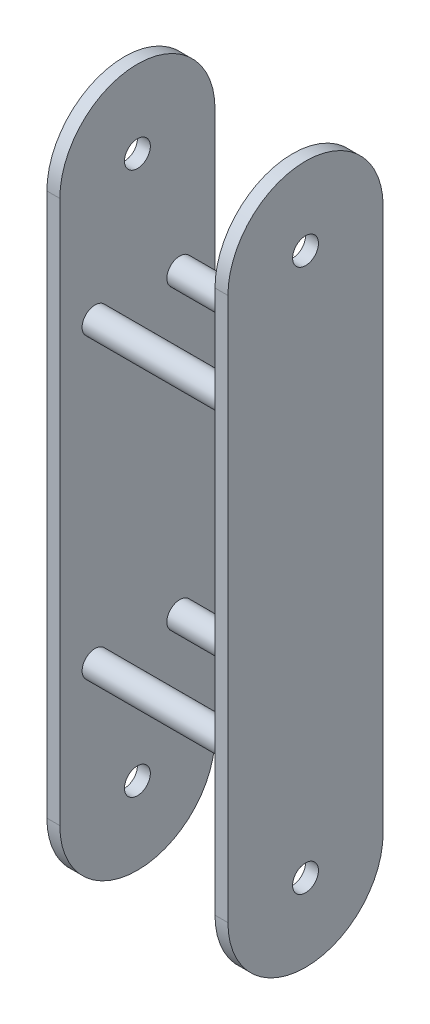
ISO-10303-21;
HEADER;
FILE_DESCRIPTION(('STEP AP214'),'2;1');
FILE_NAME('part.step','',(''),(''),'','','');
FILE_SCHEMA(('AUTOMOTIVE_DESIGN { 1 0 10303 214 1 1 1 1 }'));
ENDSEC;
DATA;
#1=APPLICATION_CONTEXT('core data for automotive mechanical design processes');
#2=APPLICATION_PROTOCOL_DEFINITION('international standard','automotive_design',2000,#1);
#3=PRODUCT_CONTEXT('',#1,'mechanical');
#4=PRODUCT('Part','Part','',(#3));
#5=PRODUCT_RELATED_PRODUCT_CATEGORY('part','',(#4));
#6=PRODUCT_DEFINITION_FORMATION('','',#4);
#7=PRODUCT_DEFINITION_CONTEXT('part definition',#1,'design');
#8=PRODUCT_DEFINITION('design','',#6,#7);
#9=PRODUCT_DEFINITION_SHAPE('','',#8);
#10=(LENGTH_UNIT() NAMED_UNIT(*) SI_UNIT(.MILLI.,.METRE.));
#11=(NAMED_UNIT(*) PLANE_ANGLE_UNIT() SI_UNIT($,.RADIAN.));
#12=(NAMED_UNIT(*) SI_UNIT($,.STERADIAN.) SOLID_ANGLE_UNIT());
#13=UNCERTAINTY_MEASURE_WITH_UNIT(LENGTH_MEASURE(1.E-05),#10,'distance_accuracy_value','');
#14=(GEOMETRIC_REPRESENTATION_CONTEXT(3) GLOBAL_UNCERTAINTY_ASSIGNED_CONTEXT((#13)) GLOBAL_UNIT_ASSIGNED_CONTEXT((#10,
#11,#12)) REPRESENTATION_CONTEXT('',''));
#15=CARTESIAN_POINT('',(0.,0.,0.));
#16=DIRECTION('',(0.,0.,1.));
#17=DIRECTION('',(1.,0.,0.));
#18=AXIS2_PLACEMENT_3D('',#15,#16,#17);
#19=CARTESIAN_POINT('',(30.,0.,30.));
#20=DIRECTION('',(0.,0.,1.));
#21=DIRECTION('',(1.,0.,0.));
#22=AXIS2_PLACEMENT_3D('',#19,#20,#21);
#23=PLANE('',#22);
#24=DIRECTION('',(0.,-1.,0.));
#25=VECTOR('',#24,1.);
#26=CARTESIAN_POINT('',(35.,0.,30.));
#27=LINE('',#26,#25);
#28=CARTESIAN_POINT('',(35.,105.,30.));
#29=VERTEX_POINT('',#28);
#30=CARTESIAN_POINT('',(35.,-105.,30.));
#31=VERTEX_POINT('',#30);
#32=EDGE_CURVE('E169',#29,#31,#27,.T.);
#33=ORIENTED_EDGE('',*,*,#32,.F.);
#34=DIRECTION('',(1.,0.,0.));
#35=VECTOR('',#34,1.);
#36=CARTESIAN_POINT('',(30.,105.,30.));
#37=LINE('',#36,#35);
#38=CARTESIAN_POINT('',(30.,105.,30.));
#39=VERTEX_POINT('',#38);
#40=EDGE_CURVE('E60',#39,#29,#37,.T.);
#41=ORIENTED_EDGE('',*,*,#40,.F.);
#42=DIRECTION('',(0.,-1.,0.));
#43=VECTOR('',#42,1.);
#44=CARTESIAN_POINT('',(30.,0.,30.));
#45=LINE('',#44,#43);
#46=CARTESIAN_POINT('',(30.,-105.,30.));
#47=VERTEX_POINT('',#46);
#48=EDGE_CURVE('E170',#39,#47,#45,.T.);
#49=ORIENTED_EDGE('',*,*,#48,.T.);
#50=DIRECTION('',(1.,0.,0.));
#51=VECTOR('',#50,1.);
#52=CARTESIAN_POINT('',(30.,-105.,30.));
#53=LINE('',#52,#51);
#54=EDGE_CURVE('E86',#47,#31,#53,.T.);
#55=ORIENTED_EDGE('',*,*,#54,.T.);
#56=EDGE_LOOP('',(#33,#41,#49,#55));
#57=FACE_BOUND('',#56,.T.);
#58=ADVANCED_FACE('F41',(#57),#23,.T.);
#59=CARTESIAN_POINT('',(30.,105.,0.));
#60=DIRECTION('',(1.,0.,0.));
#61=DIRECTION('',(0.,0.,-1.));
#62=AXIS2_PLACEMENT_3D('',#59,#60,#61);
#63=CYLINDRICAL_SURFACE('',#62,30.);
#64=CARTESIAN_POINT('',(35.,105.,0.));
#65=DIRECTION('',(1.,0.,0.));
#66=DIRECTION('',(0.,0.,-1.));
#67=AXIS2_PLACEMENT_3D('',#64,#65,#66);
#68=CIRCLE('',#67,30.);
#69=CARTESIAN_POINT('',(35.,105.,-30.));
#70=VERTEX_POINT('',#69);
#71=EDGE_CURVE('E78',#29,#70,#68,.F.);
#72=ORIENTED_EDGE('',*,*,#71,.T.);
#73=DIRECTION('',(1.,0.,0.));
#74=VECTOR('',#73,1.);
#75=CARTESIAN_POINT('',(30.,105.,-30.));
#76=LINE('',#75,#74);
#77=CARTESIAN_POINT('',(30.,105.,-30.));
#78=VERTEX_POINT('',#77);
#79=EDGE_CURVE('E197',#78,#70,#76,.T.);
#80=ORIENTED_EDGE('',*,*,#79,.F.);
#81=CARTESIAN_POINT('',(30.,105.,0.));
#82=DIRECTION('',(1.,0.,0.));
#83=DIRECTION('',(0.,0.,-1.));
#84=AXIS2_PLACEMENT_3D('',#81,#82,#83);
#85=CIRCLE('',#84,30.);
#86=EDGE_CURVE('E179',#39,#78,#85,.F.);
#87=ORIENTED_EDGE('',*,*,#86,.F.);
#88=ORIENTED_EDGE('',*,*,#40,.T.);
#89=EDGE_LOOP('',(#72,#80,#87,#88));
#90=FACE_BOUND('',#89,.T.);
#91=ADVANCED_FACE('F212',(#90),#63,.T.);
#92=CARTESIAN_POINT('',(30.,0.,-30.));
#93=DIRECTION('',(0.,0.,1.));
#94=DIRECTION('',(1.,0.,0.));
#95=AXIS2_PLACEMENT_3D('',#92,#93,#94);
#96=PLANE('',#95);
#97=DIRECTION('',(0.,-1.,0.));
#98=VECTOR('',#97,1.);
#99=CARTESIAN_POINT('',(35.,0.,-30.));
#100=LINE('',#99,#98);
#101=CARTESIAN_POINT('',(35.,-105.,-30.));
#102=VERTEX_POINT('',#101);
#103=EDGE_CURVE('E189',#70,#102,#100,.T.);
#104=ORIENTED_EDGE('',*,*,#103,.T.);
#105=DIRECTION('',(1.,0.,0.));
#106=VECTOR('',#105,1.);
#107=CARTESIAN_POINT('',(30.,-105.,-30.));
#108=LINE('',#107,#106);
#109=CARTESIAN_POINT('',(30.,-105.,-30.));
#110=VERTEX_POINT('',#109);
#111=EDGE_CURVE('E200',#110,#102,#108,.T.);
#112=ORIENTED_EDGE('',*,*,#111,.F.);
#113=DIRECTION('',(0.,-1.,0.));
#114=VECTOR('',#113,1.);
#115=CARTESIAN_POINT('',(30.,0.,-30.));
#116=LINE('',#115,#114);
#117=EDGE_CURVE('E176',#78,#110,#116,.T.);
#118=ORIENTED_EDGE('',*,*,#117,.F.);
#119=ORIENTED_EDGE('',*,*,#79,.T.);
#120=EDGE_LOOP('',(#104,#112,#118,#119));
#121=FACE_BOUND('',#120,.T.);
#122=ADVANCED_FACE('F210',(#121),#96,.F.);
#123=CARTESIAN_POINT('',(30.,-105.,0.));
#124=DIRECTION('',(1.,0.,0.));
#125=DIRECTION('',(0.,0.,-1.));
#126=AXIS2_PLACEMENT_3D('',#123,#124,#125);
#127=CYLINDRICAL_SURFACE('',#126,30.);
#128=CARTESIAN_POINT('',(35.,-105.,0.));
#129=DIRECTION('',(1.,0.,0.));
#130=DIRECTION('',(0.,0.,-1.));
#131=AXIS2_PLACEMENT_3D('',#128,#129,#130);
#132=CIRCLE('',#131,30.);
#133=EDGE_CURVE('E185',#31,#102,#132,.T.);
#134=ORIENTED_EDGE('',*,*,#133,.F.);
#135=ORIENTED_EDGE('',*,*,#54,.F.);
#136=CARTESIAN_POINT('',(30.,-105.,0.));
#137=DIRECTION('',(1.,0.,0.));
#138=DIRECTION('',(0.,0.,-1.));
#139=AXIS2_PLACEMENT_3D('',#136,#137,#138);
#140=CIRCLE('',#139,30.);
#141=EDGE_CURVE('E173',#47,#110,#140,.T.);
#142=ORIENTED_EDGE('',*,*,#141,.T.);
#143=ORIENTED_EDGE('',*,*,#111,.T.);
#144=EDGE_LOOP('',(#134,#135,#142,#143));
#145=FACE_BOUND('',#144,.T.);
#146=ADVANCED_FACE('F204',(#145),#127,.T.);
#147=CARTESIAN_POINT('',(30.,0.,0.));
#148=DIRECTION('',(1.,0.,0.));
#149=DIRECTION('',(0.,0.,-1.));
#150=AXIS2_PLACEMENT_3D('',#147,#148,#149);
#151=PLANE('',#150);
#152=CARTESIAN_POINT('',(30.,-57.5285251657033,16.3848494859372));
#153=DIRECTION('',(1.,0.,0.));
#154=DIRECTION('',(0.,0.,-1.));
#155=AXIS2_PLACEMENT_3D('',#152,#153,#154);
#156=CIRCLE('',#155,5.);
#157=CARTESIAN_POINT('',(30.,-57.5285251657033,11.3848494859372));
#158=VERTEX_POINT('',#157);
#159=EDGE_CURVE('E396',#158,#158,#156,.T.);
#160=ORIENTED_EDGE('',*,*,#159,.T.);
#161=EDGE_LOOP('',(#160));
#162=FACE_BOUND('',#161,.T.);
#163=CARTESIAN_POINT('',(30.,-57.5285251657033,-16.3848494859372));
#164=DIRECTION('',(1.,0.,0.));
#165=DIRECTION('',(0.,0.,-1.));
#166=AXIS2_PLACEMENT_3D('',#163,#164,#165);
#167=CIRCLE('',#166,5.);
#168=CARTESIAN_POINT('',(30.,-57.5285251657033,-21.3848494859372));
#169=VERTEX_POINT('',#168);
#170=EDGE_CURVE('E398',#169,#169,#167,.T.);
#171=ORIENTED_EDGE('',*,*,#170,.T.);
#172=EDGE_LOOP('',(#171));
#173=FACE_BOUND('',#172,.T.);
#174=CARTESIAN_POINT('',(30.,57.5285251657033,-16.3848494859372));
#175=DIRECTION('',(1.,0.,0.));
#176=DIRECTION('',(0.,0.,-1.));
#177=AXIS2_PLACEMENT_3D('',#174,#175,#176);
#178=CIRCLE('',#177,5.);
#179=CARTESIAN_POINT('',(30.,57.5285251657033,-21.3848494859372));
#180=VERTEX_POINT('',#179);
#181=EDGE_CURVE('E402',#180,#180,#178,.T.);
#182=ORIENTED_EDGE('',*,*,#181,.T.);
#183=EDGE_LOOP('',(#182));
#184=FACE_BOUND('',#183,.T.);
#185=CARTESIAN_POINT('',(30.,57.5285251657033,16.3848494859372));
#186=DIRECTION('',(1.,0.,0.));
#187=DIRECTION('',(0.,0.,-1.));
#188=AXIS2_PLACEMENT_3D('',#185,#186,#187);
#189=CIRCLE('',#188,5.);
#190=CARTESIAN_POINT('',(30.,57.5285251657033,11.3848494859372));
#191=VERTEX_POINT('',#190);
#192=EDGE_CURVE('E143',#191,#191,#189,.T.);
#193=ORIENTED_EDGE('',*,*,#192,.T.);
#194=EDGE_LOOP('',(#193));
#195=FACE_BOUND('',#194,.T.);
#196=CARTESIAN_POINT('',(30.,105.,0.));
#197=DIRECTION('',(1.,0.,0.));
#198=DIRECTION('',(0.,0.,-1.));
#199=AXIS2_PLACEMENT_3D('',#196,#197,#198);
#200=CIRCLE('',#199,5.);
#201=CARTESIAN_POINT('',(30.,105.,-5.));
#202=VERTEX_POINT('',#201);
#203=EDGE_CURVE('E165',#202,#202,#200,.T.);
#204=ORIENTED_EDGE('',*,*,#203,.T.);
#205=EDGE_LOOP('',(#204));
#206=FACE_BOUND('',#205,.T.);
#207=CARTESIAN_POINT('',(30.,-105.,0.));
#208=DIRECTION('',(1.,0.,0.));
#209=DIRECTION('',(0.,0.,-1.));
#210=AXIS2_PLACEMENT_3D('',#207,#208,#209);
#211=CIRCLE('',#210,5.);
#212=CARTESIAN_POINT('',(30.,-105.,-5.));
#213=VERTEX_POINT('',#212);
#214=EDGE_CURVE('E158',#213,#213,#211,.T.);
#215=ORIENTED_EDGE('',*,*,#214,.T.);
#216=EDGE_LOOP('',(#215));
#217=FACE_BOUND('',#216,.T.);
#218=ORIENTED_EDGE('',*,*,#48,.F.);
#219=ORIENTED_EDGE('',*,*,#86,.T.);
#220=ORIENTED_EDGE('',*,*,#117,.T.);
#221=ORIENTED_EDGE('',*,*,#141,.F.);
#222=EDGE_LOOP('',(#218,#219,#220,#221));
#223=FACE_BOUND('',#222,.T.);
#224=ADVANCED_FACE('F214',(#162,#173,#184,#195,#206,#217,#223),#151,.F.);
#225=CARTESIAN_POINT('',(35.,0.,0.));
#226=DIRECTION('',(1.,0.,0.));
#227=DIRECTION('',(0.,0.,-1.));
#228=AXIS2_PLACEMENT_3D('',#225,#226,#227);
#229=PLANE('',#228);
#230=CARTESIAN_POINT('',(35.,105.,0.));
#231=DIRECTION('',(1.,0.,0.));
#232=DIRECTION('',(0.,0.,-1.));
#233=AXIS2_PLACEMENT_3D('',#230,#231,#232);
#234=CIRCLE('',#233,5.);
#235=CARTESIAN_POINT('',(35.,105.,-5.));
#236=VERTEX_POINT('',#235);
#237=EDGE_CURVE('E154',#236,#236,#234,.T.);
#238=ORIENTED_EDGE('',*,*,#237,.F.);
#239=EDGE_LOOP('',(#238));
#240=FACE_BOUND('',#239,.T.);
#241=CARTESIAN_POINT('',(35.,-105.,0.));
#242=DIRECTION('',(1.,0.,0.));
#243=DIRECTION('',(0.,0.,-1.));
#244=AXIS2_PLACEMENT_3D('',#241,#242,#243);
#245=CIRCLE('',#244,5.);
#246=CARTESIAN_POINT('',(35.,-105.,-5.));
#247=VERTEX_POINT('',#246);
#248=EDGE_CURVE('E148',#247,#247,#245,.T.);
#249=ORIENTED_EDGE('',*,*,#248,.F.);
#250=EDGE_LOOP('',(#249));
#251=FACE_BOUND('',#250,.T.);
#252=ORIENTED_EDGE('',*,*,#32,.T.);
#253=ORIENTED_EDGE('',*,*,#133,.T.);
#254=ORIENTED_EDGE('',*,*,#103,.F.);
#255=ORIENTED_EDGE('',*,*,#71,.F.);
#256=EDGE_LOOP('',(#252,#253,#254,#255));
#257=FACE_BOUND('',#256,.T.);
#258=ADVANCED_FACE('F208',(#240,#251,#257),#229,.T.);
#259=CARTESIAN_POINT('',(-35.,-105.,0.));
#260=DIRECTION('',(1.,0.,0.));
#261=DIRECTION('',(0.,0.,-1.));
#262=AXIS2_PLACEMENT_3D('',#259,#260,#261);
#263=CYLINDRICAL_SURFACE('',#262,5.);
#264=ORIENTED_EDGE('',*,*,#248,.T.);
#265=EDGE_LOOP('',(#264));
#266=FACE_BOUND('',#265,.T.);
#267=ORIENTED_EDGE('',*,*,#214,.F.);
#268=EDGE_LOOP('',(#267));
#269=FACE_BOUND('',#268,.T.);
#270=ADVANCED_FACE('F222',(#266,#269),#263,.F.);
#271=CARTESIAN_POINT('',(-35.,105.,0.));
#272=DIRECTION('',(1.,0.,0.));
#273=DIRECTION('',(0.,0.,-1.));
#274=AXIS2_PLACEMENT_3D('',#271,#272,#273);
#275=CYLINDRICAL_SURFACE('',#274,5.);
#276=ORIENTED_EDGE('',*,*,#237,.T.);
#277=EDGE_LOOP('',(#276));
#278=FACE_BOUND('',#277,.T.);
#279=ORIENTED_EDGE('',*,*,#203,.F.);
#280=EDGE_LOOP('',(#279));
#281=FACE_BOUND('',#280,.T.);
#282=ADVANCED_FACE('F253',(#278,#281),#275,.F.);
#283=CARTESIAN_POINT('',(-35.,57.5285251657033,16.3848494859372));
#284=DIRECTION('',(1.,0.,0.));
#285=DIRECTION('',(0.,0.,-1.));
#286=AXIS2_PLACEMENT_3D('',#283,#284,#285);
#287=CYLINDRICAL_SURFACE('',#286,5.);
#288=CARTESIAN_POINT('',(-30.,57.5285251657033,16.3848494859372));
#289=DIRECTION('',(1.,0.,0.));
#290=DIRECTION('',(0.,0.,-1.));
#291=AXIS2_PLACEMENT_3D('',#288,#289,#290);
#292=CIRCLE('',#291,5.);
#293=CARTESIAN_POINT('',(-30.,57.5285251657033,11.3848494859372));
#294=VERTEX_POINT('',#293);
#295=EDGE_CURVE('E44',#294,#294,#292,.F.);
#296=ORIENTED_EDGE('',*,*,#295,.F.);
#297=EDGE_LOOP('',(#296));
#298=FACE_BOUND('',#297,.T.);
#299=ORIENTED_EDGE('',*,*,#192,.F.);
#300=EDGE_LOOP('',(#299));
#301=FACE_BOUND('',#300,.T.);
#302=ADVANCED_FACE('F262',(#298,#301),#287,.T.);
#303=CARTESIAN_POINT('',(-30.,-105.,0.));
#304=DIRECTION('',(-1.,0.,0.));
#305=DIRECTION('',(0.,0.,1.));
#306=AXIS2_PLACEMENT_3D('',#303,#304,#305);
#307=CYLINDRICAL_SURFACE('',#306,30.);
#308=CARTESIAN_POINT('',(-35.,-105.,0.));
#309=DIRECTION('',(1.,0.,0.));
#310=DIRECTION('',(0.,0.,-1.));
#311=AXIS2_PLACEMENT_3D('',#308,#309,#310);
#312=CIRCLE('',#311,30.);
#313=CARTESIAN_POINT('',(-35.,-105.,30.));
#314=VERTEX_POINT('',#313);
#315=CARTESIAN_POINT('',(-35.,-105.,-30.));
#316=VERTEX_POINT('',#315);
#317=EDGE_CURVE('E141',#314,#316,#312,.T.);
#318=ORIENTED_EDGE('',*,*,#317,.T.);
#319=DIRECTION('',(-1.,0.,0.));
#320=VECTOR('',#319,1.);
#321=CARTESIAN_POINT('',(-30.,-105.,-30.));
#322=LINE('',#321,#320);
#323=CARTESIAN_POINT('',(-30.,-105.,-30.));
#324=VERTEX_POINT('',#323);
#325=EDGE_CURVE('E119',#324,#316,#322,.T.);
#326=ORIENTED_EDGE('',*,*,#325,.F.);
#327=CARTESIAN_POINT('',(-30.,-105.,0.));
#328=DIRECTION('',(1.,0.,0.));
#329=DIRECTION('',(0.,0.,-1.));
#330=AXIS2_PLACEMENT_3D('',#327,#328,#329);
#331=CIRCLE('',#330,30.);
#332=CARTESIAN_POINT('',(-30.,-105.,30.));
#333=VERTEX_POINT('',#332);
#334=EDGE_CURVE('E127',#333,#324,#331,.T.);
#335=ORIENTED_EDGE('',*,*,#334,.F.);
#336=DIRECTION('',(-1.,0.,0.));
#337=VECTOR('',#336,1.);
#338=CARTESIAN_POINT('',(-30.,-105.,30.));
#339=LINE('',#338,#337);
#340=EDGE_CURVE('E435',#333,#314,#339,.T.);
#341=ORIENTED_EDGE('',*,*,#340,.T.);
#342=EDGE_LOOP('',(#318,#326,#335,#341));
#343=FACE_BOUND('',#342,.T.);
#344=ADVANCED_FACE('F139',(#343),#307,.T.);
#345=CARTESIAN_POINT('',(-30.,105.,-30.));
#346=DIRECTION('',(0.,0.,1.));
#347=DIRECTION('',(1.,0.,0.));
#348=AXIS2_PLACEMENT_3D('',#345,#346,#347);
#349=PLANE('',#348);
#350=DIRECTION('',(0.,1.,0.));
#351=VECTOR('',#350,1.);
#352=CARTESIAN_POINT('',(-35.,105.,-30.));
#353=LINE('',#352,#351);
#354=CARTESIAN_POINT('',(-35.,105.,-30.));
#355=VERTEX_POINT('',#354);
#356=EDGE_CURVE('E438',#316,#355,#353,.T.);
#357=ORIENTED_EDGE('',*,*,#356,.T.);
#358=DIRECTION('',(-1.,0.,0.));
#359=VECTOR('',#358,1.);
#360=CARTESIAN_POINT('',(-30.,105.,-30.));
#361=LINE('',#360,#359);
#362=CARTESIAN_POINT('',(-30.,105.,-30.));
#363=VERTEX_POINT('',#362);
#364=EDGE_CURVE('E122',#363,#355,#361,.T.);
#365=ORIENTED_EDGE('',*,*,#364,.F.);
#366=DIRECTION('',(0.,1.,0.));
#367=VECTOR('',#366,1.);
#368=CARTESIAN_POINT('',(-30.,105.,-30.));
#369=LINE('',#368,#367);
#370=EDGE_CURVE('E115',#324,#363,#369,.T.);
#371=ORIENTED_EDGE('',*,*,#370,.F.);
#372=ORIENTED_EDGE('',*,*,#325,.T.);
#373=EDGE_LOOP('',(#357,#365,#371,#372));
#374=FACE_BOUND('',#373,.T.);
#375=ADVANCED_FACE('F117',(#374),#349,.F.);
#376=CARTESIAN_POINT('',(-30.,105.,0.));
#377=DIRECTION('',(-1.,0.,0.));
#378=DIRECTION('',(0.,0.,1.));
#379=AXIS2_PLACEMENT_3D('',#376,#377,#378);
#380=CYLINDRICAL_SURFACE('',#379,30.);
#381=CARTESIAN_POINT('',(-35.,105.,0.));
#382=DIRECTION('',(1.,0.,0.));
#383=DIRECTION('',(0.,0.,-1.));
#384=AXIS2_PLACEMENT_3D('',#381,#382,#383);
#385=CIRCLE('',#384,30.);
#386=CARTESIAN_POINT('',(-35.,105.,30.));
#387=VERTEX_POINT('',#386);
#388=EDGE_CURVE('E441',#355,#387,#385,.T.);
#389=ORIENTED_EDGE('',*,*,#388,.T.);
#390=DIRECTION('',(-1.,0.,0.));
#391=VECTOR('',#390,1.);
#392=CARTESIAN_POINT('',(-30.,105.,30.));
#393=LINE('',#392,#391);
#394=CARTESIAN_POINT('',(-30.,105.,30.));
#395=VERTEX_POINT('',#394);
#396=EDGE_CURVE('E150',#395,#387,#393,.T.);
#397=ORIENTED_EDGE('',*,*,#396,.F.);
#398=CARTESIAN_POINT('',(-30.,105.,0.));
#399=DIRECTION('',(1.,0.,0.));
#400=DIRECTION('',(0.,0.,-1.));
#401=AXIS2_PLACEMENT_3D('',#398,#399,#400);
#402=CIRCLE('',#401,30.);
#403=EDGE_CURVE('E126',#363,#395,#402,.T.);
#404=ORIENTED_EDGE('',*,*,#403,.F.);
#405=ORIENTED_EDGE('',*,*,#364,.T.);
#406=EDGE_LOOP('',(#389,#397,#404,#405));
#407=FACE_BOUND('',#406,.T.);
#408=ADVANCED_FACE('F302',(#407),#380,.T.);
#409=CARTESIAN_POINT('',(-30.,105.,30.));
#410=DIRECTION('',(0.,0.,-1.));
#411=DIRECTION('',(-1.,0.,0.));
#412=AXIS2_PLACEMENT_3D('',#409,#410,#411);
#413=PLANE('',#412);
#414=DIRECTION('',(0.,-1.,0.));
#415=VECTOR('',#414,1.);
#416=CARTESIAN_POINT('',(-35.,105.,30.));
#417=LINE('',#416,#415);
#418=EDGE_CURVE('E137',#387,#314,#417,.T.);
#419=ORIENTED_EDGE('',*,*,#418,.T.);
#420=ORIENTED_EDGE('',*,*,#340,.F.);
#421=DIRECTION('',(0.,-1.,0.));
#422=VECTOR('',#421,1.);
#423=CARTESIAN_POINT('',(-30.,105.,30.));
#424=LINE('',#423,#422);
#425=EDGE_CURVE('E132',#395,#333,#424,.T.);
#426=ORIENTED_EDGE('',*,*,#425,.F.);
#427=ORIENTED_EDGE('',*,*,#396,.T.);
#428=EDGE_LOOP('',(#419,#420,#426,#427));
#429=FACE_BOUND('',#428,.T.);
#430=ADVANCED_FACE('F311',(#429),#413,.F.);
#431=CARTESIAN_POINT('',(-30.,-105.,0.));
#432=DIRECTION('',(1.,0.,0.));
#433=DIRECTION('',(0.,0.,-1.));
#434=AXIS2_PLACEMENT_3D('',#431,#432,#433);
#435=PLANE('',#434);
#436=CARTESIAN_POINT('',(-30.,-57.5285251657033,16.3848494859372));
#437=DIRECTION('',(1.,0.,0.));
#438=DIRECTION('',(0.,0.,-1.));
#439=AXIS2_PLACEMENT_3D('',#436,#437,#438);
#440=CIRCLE('',#439,5.);
#441=CARTESIAN_POINT('',(-30.,-57.5285251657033,11.3848494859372));
#442=VERTEX_POINT('',#441);
#443=EDGE_CURVE('E11',#442,#442,#440,.T.);
#444=ORIENTED_EDGE('',*,*,#443,.F.);
#445=EDGE_LOOP('',(#444));
#446=FACE_BOUND('',#445,.T.);
#447=CARTESIAN_POINT('',(-30.,-57.5285251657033,-16.3848494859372));
#448=DIRECTION('',(1.,0.,0.));
#449=DIRECTION('',(0.,0.,-1.));
#450=AXIS2_PLACEMENT_3D('',#447,#448,#449);
#451=CIRCLE('',#450,5.);
#452=CARTESIAN_POINT('',(-30.,-57.5285251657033,-21.3848494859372));
#453=VERTEX_POINT('',#452);
#454=EDGE_CURVE('E51',#453,#453,#451,.T.);
#455=ORIENTED_EDGE('',*,*,#454,.F.);
#456=EDGE_LOOP('',(#455));
#457=FACE_BOUND('',#456,.T.);
#458=CARTESIAN_POINT('',(-30.,57.5285251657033,-16.3848494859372));
#459=DIRECTION('',(1.,0.,0.));
#460=DIRECTION('',(0.,0.,-1.));
#461=AXIS2_PLACEMENT_3D('',#458,#459,#460);
#462=CIRCLE('',#461,5.);
#463=CARTESIAN_POINT('',(-30.,57.5285251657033,-21.3848494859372));
#464=VERTEX_POINT('',#463);
#465=EDGE_CURVE('E407',#464,#464,#462,.T.);
#466=ORIENTED_EDGE('',*,*,#465,.F.);
#467=EDGE_LOOP('',(#466));
#468=FACE_BOUND('',#467,.T.);
#469=ORIENTED_EDGE('',*,*,#295,.T.);
#470=EDGE_LOOP('',(#469));
#471=FACE_BOUND('',#470,.T.);
#472=CARTESIAN_POINT('',(-30.,105.,0.));
#473=DIRECTION('',(1.,0.,0.));
#474=DIRECTION('',(0.,0.,-1.));
#475=AXIS2_PLACEMENT_3D('',#472,#473,#474);
#476=CIRCLE('',#475,5.);
#477=CARTESIAN_POINT('',(-30.,105.,-5.));
#478=VERTEX_POINT('',#477);
#479=EDGE_CURVE('E427',#478,#478,#476,.T.);
#480=ORIENTED_EDGE('',*,*,#479,.F.);
#481=EDGE_LOOP('',(#480));
#482=FACE_BOUND('',#481,.T.);
#483=CARTESIAN_POINT('',(-30.,-105.,0.));
#484=DIRECTION('',(1.,0.,0.));
#485=DIRECTION('',(0.,0.,-1.));
#486=AXIS2_PLACEMENT_3D('',#483,#484,#485);
#487=CIRCLE('',#486,5.);
#488=CARTESIAN_POINT('',(-30.,-105.,-5.));
#489=VERTEX_POINT('',#488);
#490=EDGE_CURVE('E420',#489,#489,#487,.T.);
#491=ORIENTED_EDGE('',*,*,#490,.F.);
#492=EDGE_LOOP('',(#491));
#493=FACE_BOUND('',#492,.T.);
#494=ORIENTED_EDGE('',*,*,#334,.T.);
#495=ORIENTED_EDGE('',*,*,#370,.T.);
#496=ORIENTED_EDGE('',*,*,#403,.T.);
#497=ORIENTED_EDGE('',*,*,#425,.T.);
#498=EDGE_LOOP('',(#494,#495,#496,#497));
#499=FACE_BOUND('',#498,.T.);
#500=ADVANCED_FACE('F130',(#446,#457,#468,#471,#482,#493,#499),#435,.T.);
#501=CARTESIAN_POINT('',(-35.,-105.,0.));
#502=DIRECTION('',(1.,0.,0.));
#503=DIRECTION('',(0.,0.,-1.));
#504=AXIS2_PLACEMENT_3D('',#501,#502,#503);
#505=CYLINDRICAL_SURFACE('',#504,5.);
#506=ORIENTED_EDGE('',*,*,#490,.T.);
#507=EDGE_LOOP('',(#506));
#508=FACE_BOUND('',#507,.T.);
#509=CARTESIAN_POINT('',(-35.,-105.,0.));
#510=DIRECTION('',(1.,0.,0.));
#511=DIRECTION('',(0.,0.,-1.));
#512=AXIS2_PLACEMENT_3D('',#509,#510,#511);
#513=CIRCLE('',#512,5.);
#514=CARTESIAN_POINT('',(-35.,-105.,-5.));
#515=VERTEX_POINT('',#514);
#516=EDGE_CURVE('E415',#515,#515,#513,.T.);
#517=ORIENTED_EDGE('',*,*,#516,.F.);
#518=EDGE_LOOP('',(#517));
#519=FACE_BOUND('',#518,.T.);
#520=ADVANCED_FACE('F330',(#508,#519),#505,.F.);
#521=CARTESIAN_POINT('',(-35.,105.,0.));
#522=DIRECTION('',(1.,0.,0.));
#523=DIRECTION('',(0.,0.,-1.));
#524=AXIS2_PLACEMENT_3D('',#521,#522,#523);
#525=CYLINDRICAL_SURFACE('',#524,5.);
#526=ORIENTED_EDGE('',*,*,#479,.T.);
#527=EDGE_LOOP('',(#526));
#528=FACE_BOUND('',#527,.T.);
#529=CARTESIAN_POINT('',(-35.,105.,0.));
#530=DIRECTION('',(1.,0.,0.));
#531=DIRECTION('',(0.,0.,-1.));
#532=AXIS2_PLACEMENT_3D('',#529,#530,#531);
#533=CIRCLE('',#532,5.);
#534=CARTESIAN_POINT('',(-35.,105.,-5.));
#535=VERTEX_POINT('',#534);
#536=EDGE_CURVE('E416',#535,#535,#533,.T.);
#537=ORIENTED_EDGE('',*,*,#536,.F.);
#538=EDGE_LOOP('',(#537));
#539=FACE_BOUND('',#538,.T.);
#540=ADVANCED_FACE('F340',(#528,#539),#525,.F.);
#541=CARTESIAN_POINT('',(-35.,57.5285251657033,16.3848494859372));
#542=DIRECTION('',(1.,0.,0.));
#543=DIRECTION('',(0.,0.,-1.));
#544=AXIS2_PLACEMENT_3D('',#541,#542,#543);
#545=PLANE('',#544);
#546=ORIENTED_EDGE('',*,*,#536,.T.);
#547=EDGE_LOOP('',(#546));
#548=FACE_BOUND('',#547,.T.);
#549=ORIENTED_EDGE('',*,*,#516,.T.);
#550=EDGE_LOOP('',(#549));
#551=FACE_BOUND('',#550,.T.);
#552=ORIENTED_EDGE('',*,*,#317,.F.);
#553=ORIENTED_EDGE('',*,*,#418,.F.);
#554=ORIENTED_EDGE('',*,*,#388,.F.);
#555=ORIENTED_EDGE('',*,*,#356,.F.);
#556=EDGE_LOOP('',(#552,#553,#554,#555));
#557=FACE_BOUND('',#556,.T.);
#558=ADVANCED_FACE('F350',(#548,#551,#557),#545,.F.);
#559=CARTESIAN_POINT('',(-35.,57.5285251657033,-16.3848494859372));
#560=DIRECTION('',(1.,0.,0.));
#561=DIRECTION('',(0.,0.,-1.));
#562=AXIS2_PLACEMENT_3D('',#559,#560,#561);
#563=CYLINDRICAL_SURFACE('',#562,5.);
#564=ORIENTED_EDGE('',*,*,#465,.T.);
#565=EDGE_LOOP('',(#564));
#566=FACE_BOUND('',#565,.T.);
#567=ORIENTED_EDGE('',*,*,#181,.F.);
#568=EDGE_LOOP('',(#567));
#569=FACE_BOUND('',#568,.T.);
#570=ADVANCED_FACE('F359',(#566,#569),#563,.T.);
#571=CARTESIAN_POINT('',(-35.,-57.5285251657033,-16.3848494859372));
#572=DIRECTION('',(1.,0.,0.));
#573=DIRECTION('',(0.,0.,-1.));
#574=AXIS2_PLACEMENT_3D('',#571,#572,#573);
#575=CYLINDRICAL_SURFACE('',#574,5.);
#576=ORIENTED_EDGE('',*,*,#454,.T.);
#577=EDGE_LOOP('',(#576));
#578=FACE_BOUND('',#577,.T.);
#579=ORIENTED_EDGE('',*,*,#170,.F.);
#580=EDGE_LOOP('',(#579));
#581=FACE_BOUND('',#580,.T.);
#582=ADVANCED_FACE('F369',(#578,#581),#575,.T.);
#583=CARTESIAN_POINT('',(-35.,-57.5285251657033,16.3848494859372));
#584=DIRECTION('',(1.,0.,0.));
#585=DIRECTION('',(0.,0.,-1.));
#586=AXIS2_PLACEMENT_3D('',#583,#584,#585);
#587=CYLINDRICAL_SURFACE('',#586,5.);
#588=ORIENTED_EDGE('',*,*,#443,.T.);
#589=EDGE_LOOP('',(#588));
#590=FACE_BOUND('',#589,.T.);
#591=ORIENTED_EDGE('',*,*,#159,.F.);
#592=EDGE_LOOP('',(#591));
#593=FACE_BOUND('',#592,.T.);
#594=ADVANCED_FACE('F379',(#590,#593),#587,.T.);
#595=CLOSED_SHELL('',(#58,#91,#122,#146,#224,#258,#270,#282,#302,#344,#375,#408,#430,#500,#520,
#540,#558,#570,#582,#594));
#596=MANIFOLD_SOLID_BREP('B2',#595);
#597=ADVANCED_BREP_SHAPE_REPRESENTATION('',(#18,#596),#14);
#598=SHAPE_DEFINITION_REPRESENTATION(#9,#597);
ENDSEC;
END-ISO-10303-21;
